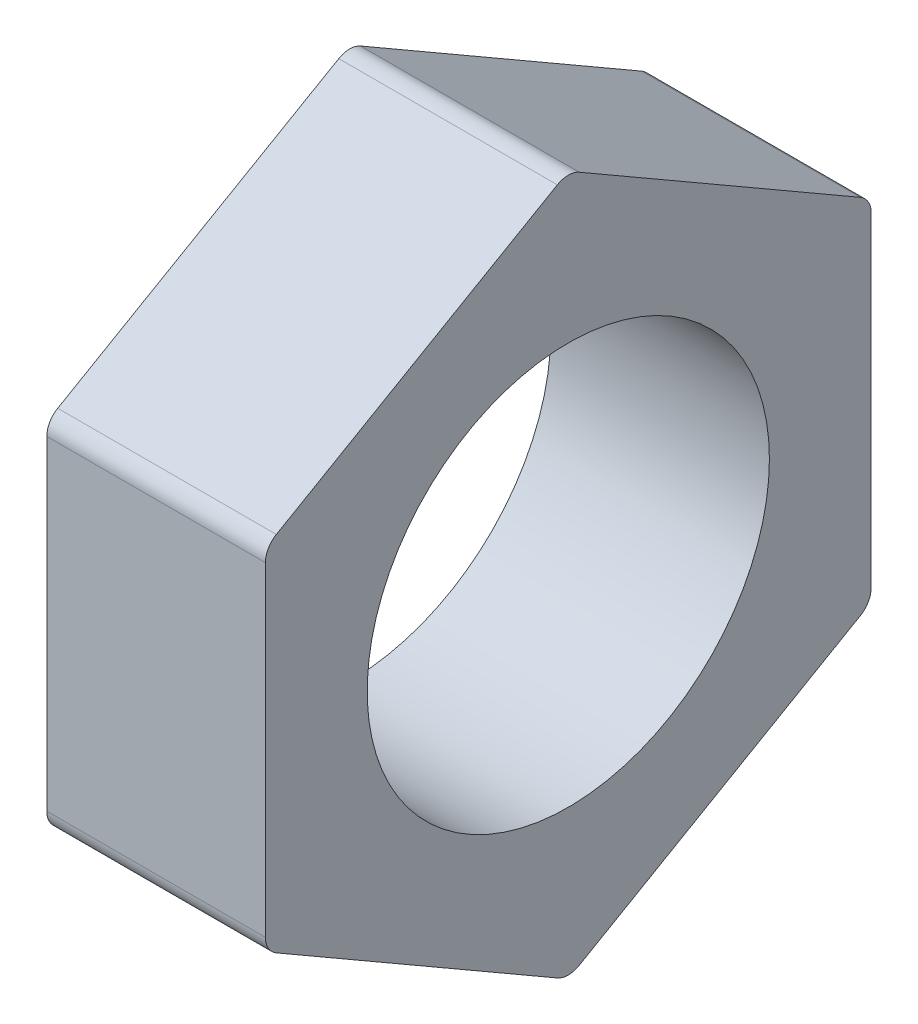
ISO-10303-21;
HEADER;
FILE_DESCRIPTION(('STEP AP214'),'2;1');
FILE_NAME('part.step','',(''),(''),'','','');
FILE_SCHEMA(('AUTOMOTIVE_DESIGN { 1 0 10303 214 1 1 1 1 }'));
ENDSEC;
DATA;
#1=APPLICATION_CONTEXT('core data for automotive mechanical design processes');
#2=APPLICATION_PROTOCOL_DEFINITION('international standard','automotive_design',2000,#1);
#3=PRODUCT_CONTEXT('',#1,'mechanical');
#4=PRODUCT('Part','Part','',(#3));
#5=PRODUCT_RELATED_PRODUCT_CATEGORY('part','',(#4));
#6=PRODUCT_DEFINITION_FORMATION('','',#4);
#7=PRODUCT_DEFINITION_CONTEXT('part definition',#1,'design');
#8=PRODUCT_DEFINITION('design','',#6,#7);
#9=PRODUCT_DEFINITION_SHAPE('','',#8);
#10=(LENGTH_UNIT() NAMED_UNIT(*) SI_UNIT(.MILLI.,.METRE.));
#11=(NAMED_UNIT(*) PLANE_ANGLE_UNIT() SI_UNIT($,.RADIAN.));
#12=(NAMED_UNIT(*) SI_UNIT($,.STERADIAN.) SOLID_ANGLE_UNIT());
#13=UNCERTAINTY_MEASURE_WITH_UNIT(LENGTH_MEASURE(1.E-05),#10,'distance_accuracy_value','');
#14=(GEOMETRIC_REPRESENTATION_CONTEXT(3) GLOBAL_UNCERTAINTY_ASSIGNED_CONTEXT((#13)) GLOBAL_UNIT_ASSIGNED_CONTEXT((#10,
#11,#12)) REPRESENTATION_CONTEXT('',''));
#15=CARTESIAN_POINT('',(0.,0.,0.));
#16=DIRECTION('',(0.,0.,1.));
#17=DIRECTION('',(1.,0.,0.));
#18=AXIS2_PLACEMENT_3D('',#15,#16,#17);
#19=CARTESIAN_POINT('',(2.5,6.00000000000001,3.46410161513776));
#20=DIRECTION('',(0.,0.866025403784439,0.5));
#21=DIRECTION('',(0.,-0.5,0.866025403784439));
#22=AXIS2_PLACEMENT_3D('',#19,#20,#21);
#23=PLANE('',#22);
#24=DIRECTION('',(0.,0.5,-0.866025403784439));
#25=VECTOR('',#24,1.);
#26=CARTESIAN_POINT('',(-2.5,6.00000000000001,3.46410161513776));
#27=LINE('',#26,#25);
#28=CARTESIAN_POINT('',(-2.5,4.14433756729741,6.67820323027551));
#29=VERTEX_POINT('',#28);
#30=CARTESIAN_POINT('',(-2.5,7.8556624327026,0.25));
#31=VERTEX_POINT('',#30);
#32=EDGE_CURVE('E169',#29,#31,#27,.T.);
#33=ORIENTED_EDGE('',*,*,#32,.F.);
#34=DIRECTION('',(-1.,0.,0.));
#35=VECTOR('',#34,1.);
#36=CARTESIAN_POINT('',(2.5,4.14433756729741,6.67820323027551));
#37=LINE('',#36,#35);
#38=CARTESIAN_POINT('',(2.5,4.14433756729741,6.67820323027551));
#39=VERTEX_POINT('',#38);
#40=EDGE_CURVE('E11',#39,#29,#37,.T.);
#41=ORIENTED_EDGE('',*,*,#40,.F.);
#42=DIRECTION('',(0.,0.5,-0.866025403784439));
#43=VECTOR('',#42,1.);
#44=CARTESIAN_POINT('',(2.5,6.00000000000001,3.46410161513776));
#45=LINE('',#44,#43);
#46=CARTESIAN_POINT('',(2.5,7.8556624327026,0.25));
#47=VERTEX_POINT('',#46);
#48=EDGE_CURVE('E266',#39,#47,#45,.T.);
#49=ORIENTED_EDGE('',*,*,#48,.T.);
#50=DIRECTION('',(-1.,0.,0.));
#51=VECTOR('',#50,1.);
#52=CARTESIAN_POINT('',(2.5,7.8556624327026,0.25));
#53=LINE('',#52,#51);
#54=EDGE_CURVE('E59',#47,#31,#53,.T.);
#55=ORIENTED_EDGE('',*,*,#54,.T.);
#56=EDGE_LOOP('',(#33,#41,#49,#55));
#57=FACE_BOUND('',#56,.T.);
#58=ADVANCED_FACE('F41',(#57),#23,.T.);
#59=CARTESIAN_POINT('',(2.5,3.71132486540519,6.42820323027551));
#60=DIRECTION('',(-1.,0.,0.));
#61=DIRECTION('',(0.,0.,1.));
#62=AXIS2_PLACEMENT_3D('',#59,#60,#61);
#63=CYLINDRICAL_SURFACE('',#62,0.500000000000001);
#64=CARTESIAN_POINT('',(-2.5,3.71132486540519,6.42820323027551));
#65=DIRECTION('',(1.,0.,0.));
#66=DIRECTION('',(0.,0.,-1.));
#67=AXIS2_PLACEMENT_3D('',#64,#65,#66);
#68=CIRCLE('',#67,0.500000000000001);
#69=CARTESIAN_POINT('',(-2.5,3.71132486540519,6.92820323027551));
#70=VERTEX_POINT('',#69);
#71=EDGE_CURVE('E172',#29,#70,#68,.T.);
#72=ORIENTED_EDGE('',*,*,#71,.T.);
#73=DIRECTION('',(-1.,0.,0.));
#74=VECTOR('',#73,1.);
#75=CARTESIAN_POINT('',(2.5,3.71132486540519,6.92820323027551));
#76=LINE('',#75,#74);
#77=CARTESIAN_POINT('',(2.5,3.71132486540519,6.92820323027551));
#78=VERTEX_POINT('',#77);
#79=EDGE_CURVE('E51',#78,#70,#76,.T.);
#80=ORIENTED_EDGE('',*,*,#79,.F.);
#81=CARTESIAN_POINT('',(2.5,3.71132486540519,6.42820323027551));
#82=DIRECTION('',(1.,0.,0.));
#83=DIRECTION('',(0.,0.,-1.));
#84=AXIS2_PLACEMENT_3D('',#81,#82,#83);
#85=CIRCLE('',#84,0.500000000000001);
#86=EDGE_CURVE('E259',#39,#78,#85,.T.);
#87=ORIENTED_EDGE('',*,*,#86,.F.);
#88=ORIENTED_EDGE('',*,*,#40,.T.);
#89=EDGE_LOOP('',(#72,#80,#87,#88));
#90=FACE_BOUND('',#89,.T.);
#91=ADVANCED_FACE('F247',(#90),#63,.T.);
#92=CARTESIAN_POINT('',(2.5,0.,6.92820323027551));
#93=DIRECTION('',(0.,0.,1.));
#94=DIRECTION('',(1.,0.,0.));
#95=AXIS2_PLACEMENT_3D('',#92,#93,#94);
#96=PLANE('',#95);
#97=DIRECTION('',(0.,1.,0.));
#98=VECTOR('',#97,1.);
#99=CARTESIAN_POINT('',(-2.5,0.,6.92820323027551));
#100=LINE('',#99,#98);
#101=CARTESIAN_POINT('',(-2.5,-3.71132486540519,6.92820323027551));
#102=VERTEX_POINT('',#101);
#103=EDGE_CURVE('E176',#102,#70,#100,.T.);
#104=ORIENTED_EDGE('',*,*,#103,.F.);
#105=DIRECTION('',(-1.,0.,0.));
#106=VECTOR('',#105,1.);
#107=CARTESIAN_POINT('',(2.5,-3.71132486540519,6.92820323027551));
#108=LINE('',#107,#106);
#109=CARTESIAN_POINT('',(2.5,-3.71132486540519,6.92820323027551));
#110=VERTEX_POINT('',#109);
#111=EDGE_CURVE('E235',#110,#102,#108,.T.);
#112=ORIENTED_EDGE('',*,*,#111,.F.);
#113=DIRECTION('',(0.,1.,0.));
#114=VECTOR('',#113,1.);
#115=CARTESIAN_POINT('',(2.5,0.,6.92820323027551));
#116=LINE('',#115,#114);
#117=EDGE_CURVE('E244',#110,#78,#116,.T.);
#118=ORIENTED_EDGE('',*,*,#117,.T.);
#119=ORIENTED_EDGE('',*,*,#79,.T.);
#120=EDGE_LOOP('',(#104,#112,#118,#119));
#121=FACE_BOUND('',#120,.T.);
#122=ADVANCED_FACE('F242',(#121),#96,.T.);
#123=CARTESIAN_POINT('',(2.5,-3.71132486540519,6.42820323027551));
#124=DIRECTION('',(-1.,0.,0.));
#125=DIRECTION('',(0.,0.,1.));
#126=AXIS2_PLACEMENT_3D('',#123,#124,#125);
#127=CYLINDRICAL_SURFACE('',#126,0.5);
#128=CARTESIAN_POINT('',(-2.5,-3.71132486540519,6.42820323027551));
#129=DIRECTION('',(1.,0.,0.));
#130=DIRECTION('',(0.,0.,-1.));
#131=AXIS2_PLACEMENT_3D('',#128,#129,#130);
#132=CIRCLE('',#131,0.5);
#133=CARTESIAN_POINT('',(-2.5,-4.14433756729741,6.67820323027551));
#134=VERTEX_POINT('',#133);
#135=EDGE_CURVE('E180',#134,#102,#132,.F.);
#136=ORIENTED_EDGE('',*,*,#135,.F.);
#137=DIRECTION('',(-1.,0.,0.));
#138=VECTOR('',#137,1.);
#139=CARTESIAN_POINT('',(2.5,-4.14433756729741,6.67820323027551));
#140=LINE('',#139,#138);
#141=CARTESIAN_POINT('',(2.5,-4.14433756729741,6.67820323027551));
#142=VERTEX_POINT('',#141);
#143=EDGE_CURVE('E232',#142,#134,#140,.T.);
#144=ORIENTED_EDGE('',*,*,#143,.F.);
#145=CARTESIAN_POINT('',(2.5,-3.71132486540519,6.42820323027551));
#146=DIRECTION('',(1.,0.,0.));
#147=DIRECTION('',(0.,0.,-1.));
#148=AXIS2_PLACEMENT_3D('',#145,#146,#147);
#149=CIRCLE('',#148,0.5);
#150=EDGE_CURVE('E256',#142,#110,#149,.F.);
#151=ORIENTED_EDGE('',*,*,#150,.T.);
#152=ORIENTED_EDGE('',*,*,#111,.T.);
#153=EDGE_LOOP('',(#136,#144,#151,#152));
#154=FACE_BOUND('',#153,.T.);
#155=ADVANCED_FACE('F253',(#154),#127,.T.);
#156=CARTESIAN_POINT('',(2.5,-6.,3.46410161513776));
#157=DIRECTION('',(0.,-0.866025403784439,0.5));
#158=DIRECTION('',(0.,-0.5,-0.866025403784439));
#159=AXIS2_PLACEMENT_3D('',#156,#157,#158);
#160=PLANE('',#159);
#161=DIRECTION('',(0.,0.5,0.866025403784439));
#162=VECTOR('',#161,1.);
#163=CARTESIAN_POINT('',(-2.5,-6.,3.46410161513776));
#164=LINE('',#163,#162);
#165=CARTESIAN_POINT('',(-2.5,-7.8556624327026,0.250000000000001));
#166=VERTEX_POINT('',#165);
#167=EDGE_CURVE('E184',#166,#134,#164,.T.);
#168=ORIENTED_EDGE('',*,*,#167,.F.);
#169=DIRECTION('',(-1.,0.,0.));
#170=VECTOR('',#169,1.);
#171=CARTESIAN_POINT('',(2.5,-7.8556624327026,0.250000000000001));
#172=LINE('',#171,#170);
#173=CARTESIAN_POINT('',(2.5,-7.8556624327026,0.250000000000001));
#174=VERTEX_POINT('',#173);
#175=EDGE_CURVE('E229',#174,#166,#172,.T.);
#176=ORIENTED_EDGE('',*,*,#175,.F.);
#177=DIRECTION('',(0.,0.5,0.866025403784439));
#178=VECTOR('',#177,1.);
#179=CARTESIAN_POINT('',(2.5,-6.,3.46410161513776));
#180=LINE('',#179,#178);
#181=EDGE_CURVE('E264',#174,#142,#180,.T.);
#182=ORIENTED_EDGE('',*,*,#181,.T.);
#183=ORIENTED_EDGE('',*,*,#143,.T.);
#184=EDGE_LOOP('',(#168,#176,#182,#183));
#185=FACE_BOUND('',#184,.T.);
#186=ADVANCED_FACE('F310',(#185),#160,.T.);
#187=CARTESIAN_POINT('',(2.5,-7.42264973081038,0.));
#188=DIRECTION('',(-1.,0.,0.));
#189=DIRECTION('',(0.,0.,1.));
#190=AXIS2_PLACEMENT_3D('',#187,#188,#189);
#191=CYLINDRICAL_SURFACE('',#190,0.499999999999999);
#192=CARTESIAN_POINT('',(-2.5,-7.42264973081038,0.));
#193=DIRECTION('',(1.,0.,0.));
#194=DIRECTION('',(0.,0.,-1.));
#195=AXIS2_PLACEMENT_3D('',#192,#193,#194);
#196=CIRCLE('',#195,0.499999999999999);
#197=CARTESIAN_POINT('',(-2.5,-7.8556624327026,-0.249999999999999));
#198=VERTEX_POINT('',#197);
#199=EDGE_CURVE('E188',#198,#166,#196,.F.);
#200=ORIENTED_EDGE('',*,*,#199,.F.);
#201=DIRECTION('',(-1.,0.,0.));
#202=VECTOR('',#201,1.);
#203=CARTESIAN_POINT('',(2.5,-7.8556624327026,-0.249999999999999));
#204=LINE('',#203,#202);
#205=CARTESIAN_POINT('',(2.5,-7.8556624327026,-0.249999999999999));
#206=VERTEX_POINT('',#205);
#207=EDGE_CURVE('E226',#206,#198,#204,.T.);
#208=ORIENTED_EDGE('',*,*,#207,.F.);
#209=CARTESIAN_POINT('',(2.5,-7.42264973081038,0.));
#210=DIRECTION('',(1.,0.,0.));
#211=DIRECTION('',(0.,0.,-1.));
#212=AXIS2_PLACEMENT_3D('',#209,#210,#211);
#213=CIRCLE('',#212,0.499999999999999);
#214=EDGE_CURVE('E272',#206,#174,#213,.F.);
#215=ORIENTED_EDGE('',*,*,#214,.T.);
#216=ORIENTED_EDGE('',*,*,#175,.T.);
#217=EDGE_LOOP('',(#200,#208,#215,#216));
#218=FACE_BOUND('',#217,.T.);
#219=ADVANCED_FACE('F313',(#218),#191,.T.);
#220=CARTESIAN_POINT('',(2.5,-6.,-3.46410161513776));
#221=DIRECTION('',(0.,-0.866025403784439,-0.5));
#222=DIRECTION('',(0.,0.5,-0.866025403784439));
#223=AXIS2_PLACEMENT_3D('',#220,#221,#222);
#224=PLANE('',#223);
#225=DIRECTION('',(0.,-0.5,0.866025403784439));
#226=VECTOR('',#225,1.);
#227=CARTESIAN_POINT('',(-2.5,-6.,-3.46410161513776));
#228=LINE('',#227,#226);
#229=CARTESIAN_POINT('',(-2.5,-4.14433756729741,-6.67820323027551));
#230=VERTEX_POINT('',#229);
#231=EDGE_CURVE('E192',#230,#198,#228,.T.);
#232=ORIENTED_EDGE('',*,*,#231,.F.);
#233=DIRECTION('',(-1.,0.,0.));
#234=VECTOR('',#233,1.);
#235=CARTESIAN_POINT('',(2.5,-4.14433756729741,-6.67820323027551));
#236=LINE('',#235,#234);
#237=CARTESIAN_POINT('',(2.5,-4.14433756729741,-6.67820323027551));
#238=VERTEX_POINT('',#237);
#239=EDGE_CURVE('E223',#238,#230,#236,.T.);
#240=ORIENTED_EDGE('',*,*,#239,.F.);
#241=DIRECTION('',(0.,-0.5,0.866025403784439));
#242=VECTOR('',#241,1.);
#243=CARTESIAN_POINT('',(2.5,-6.,-3.46410161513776));
#244=LINE('',#243,#242);
#245=EDGE_CURVE('E276',#238,#206,#244,.T.);
#246=ORIENTED_EDGE('',*,*,#245,.T.);
#247=ORIENTED_EDGE('',*,*,#207,.T.);
#248=EDGE_LOOP('',(#232,#240,#246,#247));
#249=FACE_BOUND('',#248,.T.);
#250=ADVANCED_FACE('F317',(#249),#224,.T.);
#251=CARTESIAN_POINT('',(2.5,-3.71132486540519,-6.42820323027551));
#252=DIRECTION('',(-1.,0.,0.));
#253=DIRECTION('',(0.,0.,1.));
#254=AXIS2_PLACEMENT_3D('',#251,#252,#253);
#255=CYLINDRICAL_SURFACE('',#254,0.5);
#256=CARTESIAN_POINT('',(-2.5,-3.71132486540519,-6.42820323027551));
#257=DIRECTION('',(1.,0.,0.));
#258=DIRECTION('',(0.,0.,-1.));
#259=AXIS2_PLACEMENT_3D('',#256,#257,#258);
#260=CIRCLE('',#259,0.5);
#261=CARTESIAN_POINT('',(-2.5,-3.71132486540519,-6.92820323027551));
#262=VERTEX_POINT('',#261);
#263=EDGE_CURVE('E196',#262,#230,#260,.F.);
#264=ORIENTED_EDGE('',*,*,#263,.F.);
#265=DIRECTION('',(-1.,0.,0.));
#266=VECTOR('',#265,1.);
#267=CARTESIAN_POINT('',(2.5,-3.71132486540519,-6.92820323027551));
#268=LINE('',#267,#266);
#269=CARTESIAN_POINT('',(2.5,-3.71132486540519,-6.92820323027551));
#270=VERTEX_POINT('',#269);
#271=EDGE_CURVE('E220',#270,#262,#268,.T.);
#272=ORIENTED_EDGE('',*,*,#271,.F.);
#273=CARTESIAN_POINT('',(2.5,-3.71132486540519,-6.42820323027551));
#274=DIRECTION('',(1.,0.,0.));
#275=DIRECTION('',(0.,0.,-1.));
#276=AXIS2_PLACEMENT_3D('',#273,#274,#275);
#277=CIRCLE('',#276,0.5);
#278=EDGE_CURVE('E280',#270,#238,#277,.F.);
#279=ORIENTED_EDGE('',*,*,#278,.T.);
#280=ORIENTED_EDGE('',*,*,#239,.T.);
#281=EDGE_LOOP('',(#264,#272,#279,#280));
#282=FACE_BOUND('',#281,.T.);
#283=ADVANCED_FACE('F321',(#282),#255,.T.);
#284=CARTESIAN_POINT('',(2.5,0.,-6.92820323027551));
#285=DIRECTION('',(0.,0.,-1.));
#286=DIRECTION('',(-1.,0.,0.));
#287=AXIS2_PLACEMENT_3D('',#284,#285,#286);
#288=PLANE('',#287);
#289=DIRECTION('',(0.,-1.,0.));
#290=VECTOR('',#289,1.);
#291=CARTESIAN_POINT('',(-2.5,0.,-6.92820323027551));
#292=LINE('',#291,#290);
#293=CARTESIAN_POINT('',(-2.5,3.71132486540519,-6.92820323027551));
#294=VERTEX_POINT('',#293);
#295=EDGE_CURVE('E200',#294,#262,#292,.T.);
#296=ORIENTED_EDGE('',*,*,#295,.F.);
#297=DIRECTION('',(-1.,0.,0.));
#298=VECTOR('',#297,1.);
#299=CARTESIAN_POINT('',(2.5,3.71132486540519,-6.92820323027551));
#300=LINE('',#299,#298);
#301=CARTESIAN_POINT('',(2.5,3.71132486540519,-6.92820323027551));
#302=VERTEX_POINT('',#301);
#303=EDGE_CURVE('E143',#302,#294,#300,.T.);
#304=ORIENTED_EDGE('',*,*,#303,.F.);
#305=DIRECTION('',(0.,-1.,0.));
#306=VECTOR('',#305,1.);
#307=CARTESIAN_POINT('',(2.5,0.,-6.92820323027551));
#308=LINE('',#307,#306);
#309=EDGE_CURVE('E154',#302,#270,#308,.T.);
#310=ORIENTED_EDGE('',*,*,#309,.T.);
#311=ORIENTED_EDGE('',*,*,#271,.T.);
#312=EDGE_LOOP('',(#296,#304,#310,#311));
#313=FACE_BOUND('',#312,.T.);
#314=ADVANCED_FACE('F286',(#313),#288,.T.);
#315=CARTESIAN_POINT('',(2.5,3.71132486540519,-6.42820323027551));
#316=DIRECTION('',(-1.,0.,0.));
#317=DIRECTION('',(0.,0.,1.));
#318=AXIS2_PLACEMENT_3D('',#315,#316,#317);
#319=CYLINDRICAL_SURFACE('',#318,0.5);
#320=CARTESIAN_POINT('',(-2.5,3.71132486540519,-6.42820323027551));
#321=DIRECTION('',(1.,0.,0.));
#322=DIRECTION('',(0.,0.,-1.));
#323=AXIS2_PLACEMENT_3D('',#320,#321,#322);
#324=CIRCLE('',#323,0.5);
#325=CARTESIAN_POINT('',(-2.5,4.14433756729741,-6.67820323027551));
#326=VERTEX_POINT('',#325);
#327=EDGE_CURVE('E138',#326,#294,#324,.F.);
#328=ORIENTED_EDGE('',*,*,#327,.F.);
#329=DIRECTION('',(-1.,0.,0.));
#330=VECTOR('',#329,1.);
#331=CARTESIAN_POINT('',(2.5,4.14433756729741,-6.67820323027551));
#332=LINE('',#331,#330);
#333=CARTESIAN_POINT('',(2.5,4.14433756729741,-6.67820323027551));
#334=VERTEX_POINT('',#333);
#335=EDGE_CURVE('E133',#334,#326,#332,.T.);
#336=ORIENTED_EDGE('',*,*,#335,.F.);
#337=CARTESIAN_POINT('',(2.5,3.71132486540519,-6.42820323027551));
#338=DIRECTION('',(1.,0.,0.));
#339=DIRECTION('',(0.,0.,-1.));
#340=AXIS2_PLACEMENT_3D('',#337,#338,#339);
#341=CIRCLE('',#340,0.5);
#342=EDGE_CURVE('E136',#334,#302,#341,.F.);
#343=ORIENTED_EDGE('',*,*,#342,.T.);
#344=ORIENTED_EDGE('',*,*,#303,.T.);
#345=EDGE_LOOP('',(#328,#336,#343,#344));
#346=FACE_BOUND('',#345,.T.);
#347=ADVANCED_FACE('F135',(#346),#319,.T.);
#348=CARTESIAN_POINT('',(2.5,6.,-3.46410161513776));
#349=DIRECTION('',(0.,0.866025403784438,-0.5));
#350=DIRECTION('',(0.,0.5,0.866025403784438));
#351=AXIS2_PLACEMENT_3D('',#348,#349,#350);
#352=PLANE('',#351);
#353=DIRECTION('',(0.,-0.5,-0.866025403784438));
#354=VECTOR('',#353,1.);
#355=CARTESIAN_POINT('',(-2.5,6.,-3.46410161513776));
#356=LINE('',#355,#354);
#357=CARTESIAN_POINT('',(-2.5,7.8556624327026,-0.250000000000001));
#358=VERTEX_POINT('',#357);
#359=EDGE_CURVE('E206',#358,#326,#356,.T.);
#360=ORIENTED_EDGE('',*,*,#359,.F.);
#361=DIRECTION('',(-1.,0.,0.));
#362=VECTOR('',#361,1.);
#363=CARTESIAN_POINT('',(2.5,7.8556624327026,-0.250000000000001));
#364=LINE('',#363,#362);
#365=CARTESIAN_POINT('',(2.5,7.8556624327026,-0.250000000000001));
#366=VERTEX_POINT('',#365);
#367=EDGE_CURVE('E96',#366,#358,#364,.T.);
#368=ORIENTED_EDGE('',*,*,#367,.F.);
#369=DIRECTION('',(0.,-0.5,-0.866025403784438));
#370=VECTOR('',#369,1.);
#371=CARTESIAN_POINT('',(2.5,6.,-3.46410161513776));
#372=LINE('',#371,#370);
#373=EDGE_CURVE('E151',#366,#334,#372,.T.);
#374=ORIENTED_EDGE('',*,*,#373,.T.);
#375=ORIENTED_EDGE('',*,*,#335,.T.);
#376=EDGE_LOOP('',(#360,#368,#374,#375));
#377=FACE_BOUND('',#376,.T.);
#378=ADVANCED_FACE('F157',(#377),#352,.T.);
#379=CARTESIAN_POINT('',(2.5,0.,0.));
#380=DIRECTION('',(-1.,0.,0.));
#381=DIRECTION('',(0.,0.,1.));
#382=AXIS2_PLACEMENT_3D('',#379,#380,#381);
#383=CYLINDRICAL_SURFACE('',#382,4.6);
#384=CARTESIAN_POINT('',(2.5,0.,0.));
#385=DIRECTION('',(1.,0.,0.));
#386=DIRECTION('',(0.,0.,-1.));
#387=AXIS2_PLACEMENT_3D('',#384,#385,#386);
#388=CIRCLE('',#387,4.6);
#389=CARTESIAN_POINT('',(2.5,0.,-4.6));
#390=VERTEX_POINT('',#389);
#391=EDGE_CURVE('E213',#390,#390,#388,.T.);
#392=ORIENTED_EDGE('',*,*,#391,.T.);
#393=EDGE_LOOP('',(#392));
#394=FACE_BOUND('',#393,.T.);
#395=CARTESIAN_POINT('',(-2.5,0.,0.));
#396=DIRECTION('',(1.,0.,0.));
#397=DIRECTION('',(0.,0.,-1.));
#398=AXIS2_PLACEMENT_3D('',#395,#396,#397);
#399=CIRCLE('',#398,4.6);
#400=CARTESIAN_POINT('',(-2.5,0.,-4.6));
#401=VERTEX_POINT('',#400);
#402=EDGE_CURVE('E165',#401,#401,#399,.T.);
#403=ORIENTED_EDGE('',*,*,#402,.F.);
#404=EDGE_LOOP('',(#403));
#405=FACE_BOUND('',#404,.T.);
#406=ADVANCED_FACE('F43',(#394,#405),#383,.F.);
#407=CARTESIAN_POINT('',(2.5,7.42264973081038,0.));
#408=DIRECTION('',(-1.,0.,0.));
#409=DIRECTION('',(0.,0.,1.));
#410=AXIS2_PLACEMENT_3D('',#407,#408,#409);
#411=CYLINDRICAL_SURFACE('',#410,0.5);
#412=CARTESIAN_POINT('',(-2.5,7.42264973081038,0.));
#413=DIRECTION('',(1.,0.,0.));
#414=DIRECTION('',(0.,0.,-1.));
#415=AXIS2_PLACEMENT_3D('',#412,#413,#414);
#416=CIRCLE('',#415,0.5);
#417=EDGE_CURVE('E209',#31,#358,#416,.F.);
#418=ORIENTED_EDGE('',*,*,#417,.F.);
#419=ORIENTED_EDGE('',*,*,#54,.F.);
#420=CARTESIAN_POINT('',(2.5,7.42264973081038,0.));
#421=DIRECTION('',(1.,0.,0.));
#422=DIRECTION('',(0.,0.,-1.));
#423=AXIS2_PLACEMENT_3D('',#420,#421,#422);
#424=CIRCLE('',#423,0.5);
#425=EDGE_CURVE('E159',#47,#366,#424,.F.);
#426=ORIENTED_EDGE('',*,*,#425,.T.);
#427=ORIENTED_EDGE('',*,*,#367,.T.);
#428=EDGE_LOOP('',(#418,#419,#426,#427));
#429=FACE_BOUND('',#428,.T.);
#430=ADVANCED_FACE('F288',(#429),#411,.T.);
#431=CARTESIAN_POINT('',(2.5,0.,0.));
#432=DIRECTION('',(1.,0.,0.));
#433=DIRECTION('',(0.,0.,-1.));
#434=AXIS2_PLACEMENT_3D('',#431,#432,#433);
#435=PLANE('',#434);
#436=ORIENTED_EDGE('',*,*,#391,.F.);
#437=EDGE_LOOP('',(#436));
#438=FACE_BOUND('',#437,.T.);
#439=ORIENTED_EDGE('',*,*,#48,.F.);
#440=ORIENTED_EDGE('',*,*,#86,.T.);
#441=ORIENTED_EDGE('',*,*,#117,.F.);
#442=ORIENTED_EDGE('',*,*,#150,.F.);
#443=ORIENTED_EDGE('',*,*,#181,.F.);
#444=ORIENTED_EDGE('',*,*,#214,.F.);
#445=ORIENTED_EDGE('',*,*,#245,.F.);
#446=ORIENTED_EDGE('',*,*,#278,.F.);
#447=ORIENTED_EDGE('',*,*,#309,.F.);
#448=ORIENTED_EDGE('',*,*,#342,.F.);
#449=ORIENTED_EDGE('',*,*,#373,.F.);
#450=ORIENTED_EDGE('',*,*,#425,.F.);
#451=EDGE_LOOP('',(#439,#440,#441,#442,#443,#444,#445,#446,#447,#448,#449,#450));
#452=FACE_BOUND('',#451,.T.);
#453=ADVANCED_FACE('F149',(#438,#452),#435,.T.);
#454=CARTESIAN_POINT('',(-2.5,0.,0.));
#455=DIRECTION('',(1.,0.,0.));
#456=DIRECTION('',(0.,0.,-1.));
#457=AXIS2_PLACEMENT_3D('',#454,#455,#456);
#458=PLANE('',#457);
#459=ORIENTED_EDGE('',*,*,#402,.T.);
#460=EDGE_LOOP('',(#459));
#461=FACE_BOUND('',#460,.T.);
#462=ORIENTED_EDGE('',*,*,#32,.T.);
#463=ORIENTED_EDGE('',*,*,#417,.T.);
#464=ORIENTED_EDGE('',*,*,#359,.T.);
#465=ORIENTED_EDGE('',*,*,#327,.T.);
#466=ORIENTED_EDGE('',*,*,#295,.T.);
#467=ORIENTED_EDGE('',*,*,#263,.T.);
#468=ORIENTED_EDGE('',*,*,#231,.T.);
#469=ORIENTED_EDGE('',*,*,#199,.T.);
#470=ORIENTED_EDGE('',*,*,#167,.T.);
#471=ORIENTED_EDGE('',*,*,#135,.T.);
#472=ORIENTED_EDGE('',*,*,#103,.T.);
#473=ORIENTED_EDGE('',*,*,#71,.F.);
#474=EDGE_LOOP('',(#462,#463,#464,#465,#466,#467,#468,#469,#470,#471,#472,#473));
#475=FACE_BOUND('',#474,.T.);
#476=ADVANCED_FACE('F249',(#461,#475),#458,.F.);
#477=CLOSED_SHELL('',(#58,#91,#122,#155,#186,#219,#250,#283,#314,#347,#378,#406,#430,#453,#476));
#478=MANIFOLD_SOLID_BREP('B2',#477);
#479=ADVANCED_BREP_SHAPE_REPRESENTATION('',(#18,#478),#14);
#480=SHAPE_DEFINITION_REPRESENTATION(#9,#479);
ENDSEC;
END-ISO-10303-21;
